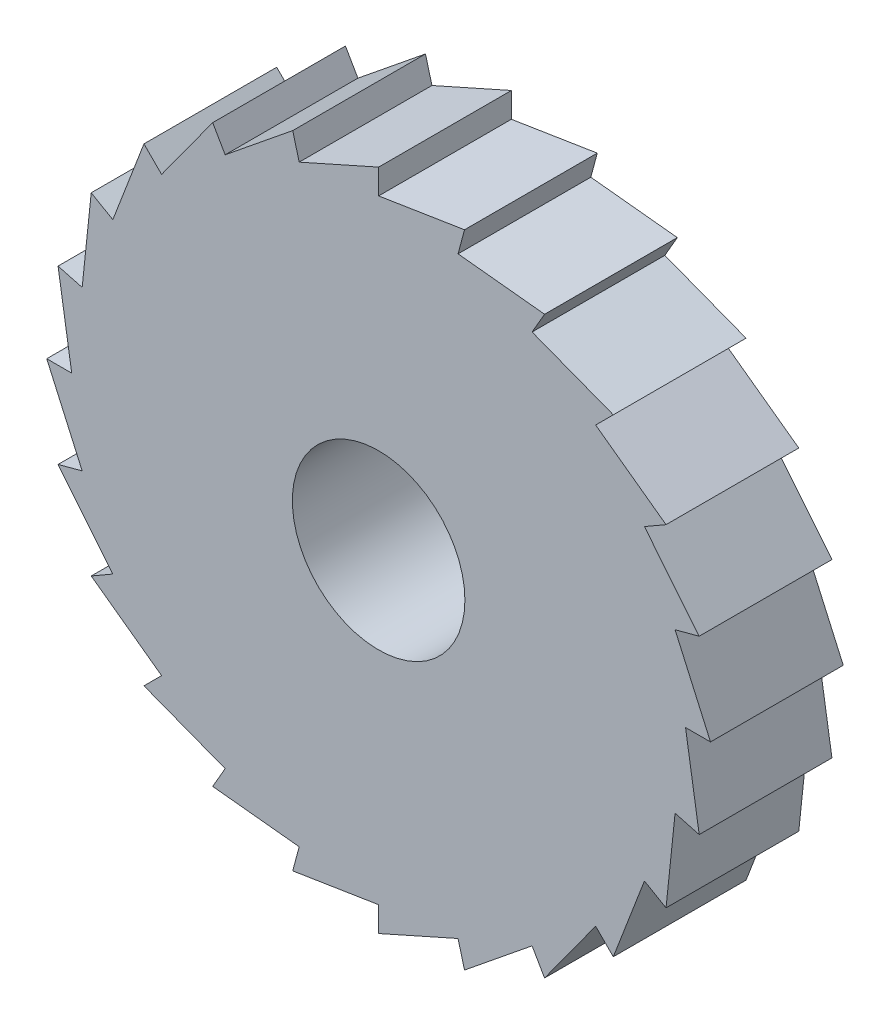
from build123d import *

# Parameters (mm, degrees)
BOSS_EXTRUDE1_DEPTH = 10
SKETCH2_R           = 6.5
CUT_EXTRUDE1_DEPTH  = 10


with BuildPart() as part:
    # Sketch1 → Boss-Extrude1 (new body)
    with BuildSketch(Plane.XY):
        Polygon((-5.983896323, 22.332205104), (0, 25), (0, 23.12), (6.470476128, 24.148145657), (5.983896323, 22.332205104), (12.5, 21.650635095), (11.56, 20.022507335), (17.67766953, 17.67766953), (16.348308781, 16.348308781), (21.650635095, 12.5), (20.022507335, 11.56), (24.148145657, 6.470476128), (22.332205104, 5.983896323), (25, 0), (23.12, 0), (24.148145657, -6.470476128), (22.332205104, -5.983896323), (21.650635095, -12.5), (20.022507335, -11.56), (17.67766953, -17.67766953), (16.348308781, -16.348308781), (12.5, -21.650635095), (11.56, -20.022507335), (6.470476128, -24.148145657), (5.983896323, -22.332205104), (0, -25), (0, -23.12), (-6.470476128, -24.148145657), (-5.983896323, -22.332205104), (-12.5, -21.650635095), (-11.56, -20.022507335), (-17.67766953, -17.67766953), (-16.348308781, -16.348308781), (-21.650635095, -12.5), (-20.022507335, -11.56), (-24.148145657, -6.470476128), (-22.332205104, -5.983896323), (-25, 0), (-23.12, 0), (-24.148145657, 6.470476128), (-22.332205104, 5.983896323), (-21.650635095, 12.5), (-20.022507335, 11.56), (-17.67766953, 17.67766953), (-16.348308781, 16.348308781), (-12.5, 21.650635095), (-11.56, 20.022507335), (-6.470476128, 24.148145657), align=None)
    extrude(amount=BOSS_EXTRUDE1_DEPTH)

    # Sketch2 → Cut-Extrude1 (cut)
    with BuildSketch(Plane.XY.offset(10)):
        Circle(SKETCH2_R)
    extrude(amount=-CUT_EXTRUDE1_DEPTH, mode=Mode.SUBTRACT)


solid = part.part
